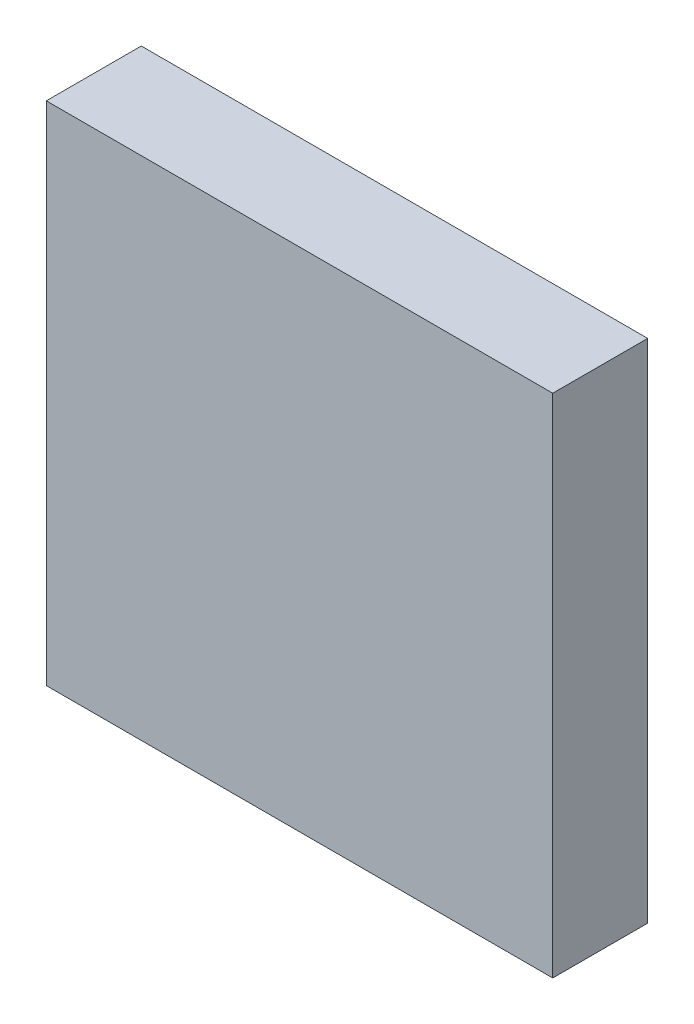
ISO-10303-21;
HEADER;
FILE_DESCRIPTION(('STEP AP214'),'2;1');
FILE_NAME('part.step','',(''),(''),'','','');
FILE_SCHEMA(('AUTOMOTIVE_DESIGN { 1 0 10303 214 1 1 1 1 }'));
ENDSEC;
DATA;
#1=APPLICATION_CONTEXT('core data for automotive mechanical design processes');
#2=APPLICATION_PROTOCOL_DEFINITION('international standard','automotive_design',2000,#1);
#3=PRODUCT_CONTEXT('',#1,'mechanical');
#4=PRODUCT('Part','Part','',(#3));
#5=PRODUCT_RELATED_PRODUCT_CATEGORY('part','',(#4));
#6=PRODUCT_DEFINITION_FORMATION('','',#4);
#7=PRODUCT_DEFINITION_CONTEXT('part definition',#1,'design');
#8=PRODUCT_DEFINITION('design','',#6,#7);
#9=PRODUCT_DEFINITION_SHAPE('','',#8);
#10=(LENGTH_UNIT() NAMED_UNIT(*) SI_UNIT(.MILLI.,.METRE.));
#11=(NAMED_UNIT(*) PLANE_ANGLE_UNIT() SI_UNIT($,.RADIAN.));
#12=(NAMED_UNIT(*) SI_UNIT($,.STERADIAN.) SOLID_ANGLE_UNIT());
#13=UNCERTAINTY_MEASURE_WITH_UNIT(LENGTH_MEASURE(1.E-05),#10,'distance_accuracy_value','');
#14=(GEOMETRIC_REPRESENTATION_CONTEXT(3) GLOBAL_UNCERTAINTY_ASSIGNED_CONTEXT((#13)) GLOBAL_UNIT_ASSIGNED_CONTEXT((#10,
#11,#12)) REPRESENTATION_CONTEXT('',''));
#15=CARTESIAN_POINT('',(0.,0.,0.));
#16=DIRECTION('',(0.,0.,1.));
#17=DIRECTION('',(1.,0.,0.));
#18=AXIS2_PLACEMENT_3D('',#15,#16,#17);
#19=CARTESIAN_POINT('',(0.,-101.6,0.));
#20=DIRECTION('',(-1.,0.,0.));
#21=DIRECTION('',(0.,0.,1.));
#22=AXIS2_PLACEMENT_3D('',#19,#20,#21);
#23=PLANE('',#22);
#24=DIRECTION('',(0.,0.,1.));
#25=VECTOR('',#24,1.);
#26=CARTESIAN_POINT('',(0.,0.,0.));
#27=LINE('',#26,#25);
#28=CARTESIAN_POINT('',(0.,0.,-19.05));
#29=VERTEX_POINT('',#28);
#30=CARTESIAN_POINT('',(0.,0.,0.));
#31=VERTEX_POINT('',#30);
#32=EDGE_CURVE('E96',#29,#31,#27,.T.);
#33=ORIENTED_EDGE('',*,*,#32,.F.);
#34=DIRECTION('',(0.,1.,0.));
#35=VECTOR('',#34,1.);
#36=CARTESIAN_POINT('',(0.,-101.6,-19.05));
#37=LINE('',#36,#35);
#38=CARTESIAN_POINT('',(0.,-101.6,-19.05));
#39=VERTEX_POINT('',#38);
#40=EDGE_CURVE('E11',#39,#29,#37,.T.);
#41=ORIENTED_EDGE('',*,*,#40,.F.);
#42=DIRECTION('',(0.,0.,1.));
#43=VECTOR('',#42,1.);
#44=CARTESIAN_POINT('',(0.,-101.6,0.));
#45=LINE('',#44,#43);
#46=CARTESIAN_POINT('',(0.,-101.6,0.));
#47=VERTEX_POINT('',#46);
#48=EDGE_CURVE('E90',#39,#47,#45,.T.);
#49=ORIENTED_EDGE('',*,*,#48,.T.);
#50=DIRECTION('',(0.,1.,0.));
#51=VECTOR('',#50,1.);
#52=CARTESIAN_POINT('',(0.,-101.6,0.));
#53=LINE('',#52,#51);
#54=EDGE_CURVE('E35',#47,#31,#53,.T.);
#55=ORIENTED_EDGE('',*,*,#54,.T.);
#56=EDGE_LOOP('',(#33,#41,#49,#55));
#57=FACE_BOUND('',#56,.T.);
#58=ADVANCED_FACE('F32',(#57),#23,.T.);
#59=CARTESIAN_POINT('',(0.,-101.6,-19.05));
#60=DIRECTION('',(0.,0.,-1.));
#61=DIRECTION('',(-1.,0.,0.));
#62=AXIS2_PLACEMENT_3D('',#59,#60,#61);
#63=PLANE('',#62);
#64=DIRECTION('',(-1.,0.,0.));
#65=VECTOR('',#64,1.);
#66=CARTESIAN_POINT('',(0.,0.,-19.05));
#67=LINE('',#66,#65);
#68=CARTESIAN_POINT('',(101.6,0.,-19.05));
#69=VERTEX_POINT('',#68);
#70=EDGE_CURVE('E92',#69,#29,#67,.T.);
#71=ORIENTED_EDGE('',*,*,#70,.F.);
#72=DIRECTION('',(0.,1.,0.));
#73=VECTOR('',#72,1.);
#74=CARTESIAN_POINT('',(101.6,-101.6,-19.05));
#75=LINE('',#74,#73);
#76=CARTESIAN_POINT('',(101.6,-101.6,-19.05));
#77=VERTEX_POINT('',#76);
#78=EDGE_CURVE('E41',#77,#69,#75,.T.);
#79=ORIENTED_EDGE('',*,*,#78,.F.);
#80=DIRECTION('',(-1.,0.,0.));
#81=VECTOR('',#80,1.);
#82=CARTESIAN_POINT('',(0.,-101.6,-19.05));
#83=LINE('',#82,#81);
#84=EDGE_CURVE('E87',#77,#39,#83,.T.);
#85=ORIENTED_EDGE('',*,*,#84,.T.);
#86=ORIENTED_EDGE('',*,*,#40,.T.);
#87=EDGE_LOOP('',(#71,#79,#85,#86));
#88=FACE_BOUND('',#87,.T.);
#89=ADVANCED_FACE('F106',(#88),#63,.T.);
#90=CARTESIAN_POINT('',(101.6,-101.6,0.));
#91=DIRECTION('',(1.,0.,0.));
#92=DIRECTION('',(0.,0.,-1.));
#93=AXIS2_PLACEMENT_3D('',#90,#91,#92);
#94=PLANE('',#93);
#95=DIRECTION('',(0.,0.,-1.));
#96=VECTOR('',#95,1.);
#97=CARTESIAN_POINT('',(101.6,0.,0.));
#98=LINE('',#97,#96);
#99=CARTESIAN_POINT('',(101.6,0.,0.));
#100=VERTEX_POINT('',#99);
#101=EDGE_CURVE('E82',#100,#69,#98,.T.);
#102=ORIENTED_EDGE('',*,*,#101,.F.);
#103=DIRECTION('',(0.,1.,0.));
#104=VECTOR('',#103,1.);
#105=CARTESIAN_POINT('',(101.6,-101.6,0.));
#106=LINE('',#105,#104);
#107=CARTESIAN_POINT('',(101.6,-101.6,0.));
#108=VERTEX_POINT('',#107);
#109=EDGE_CURVE('E77',#108,#100,#106,.T.);
#110=ORIENTED_EDGE('',*,*,#109,.F.);
#111=DIRECTION('',(0.,0.,-1.));
#112=VECTOR('',#111,1.);
#113=CARTESIAN_POINT('',(101.6,-101.6,0.));
#114=LINE('',#113,#112);
#115=EDGE_CURVE('E80',#108,#77,#114,.T.);
#116=ORIENTED_EDGE('',*,*,#115,.T.);
#117=ORIENTED_EDGE('',*,*,#78,.T.);
#118=EDGE_LOOP('',(#102,#110,#116,#117));
#119=FACE_BOUND('',#118,.T.);
#120=ADVANCED_FACE('F79',(#119),#94,.T.);
#121=CARTESIAN_POINT('',(0.,-101.6,0.));
#122=DIRECTION('',(0.,0.,1.));
#123=DIRECTION('',(1.,0.,0.));
#124=AXIS2_PLACEMENT_3D('',#121,#122,#123);
#125=PLANE('',#124);
#126=DIRECTION('',(1.,0.,0.));
#127=VECTOR('',#126,1.);
#128=CARTESIAN_POINT('',(0.,0.,0.));
#129=LINE('',#128,#127);
#130=EDGE_CURVE('E99',#31,#100,#129,.T.);
#131=ORIENTED_EDGE('',*,*,#130,.F.);
#132=ORIENTED_EDGE('',*,*,#54,.F.);
#133=DIRECTION('',(1.,0.,0.));
#134=VECTOR('',#133,1.);
#135=CARTESIAN_POINT('',(0.,-101.6,0.));
#136=LINE('',#135,#134);
#137=EDGE_CURVE('E86',#47,#108,#136,.T.);
#138=ORIENTED_EDGE('',*,*,#137,.T.);
#139=ORIENTED_EDGE('',*,*,#109,.T.);
#140=EDGE_LOOP('',(#131,#132,#138,#139));
#141=FACE_BOUND('',#140,.T.);
#142=ADVANCED_FACE('F89',(#141),#125,.T.);
#143=CARTESIAN_POINT('',(0.,-101.6,-19.05));
#144=DIRECTION('',(0.,-1.,0.));
#145=DIRECTION('',(0.,0.,-1.));
#146=AXIS2_PLACEMENT_3D('',#143,#144,#145);
#147=PLANE('',#146);
#148=ORIENTED_EDGE('',*,*,#48,.F.);
#149=ORIENTED_EDGE('',*,*,#84,.F.);
#150=ORIENTED_EDGE('',*,*,#115,.F.);
#151=ORIENTED_EDGE('',*,*,#137,.F.);
#152=EDGE_LOOP('',(#148,#149,#150,#151));
#153=FACE_BOUND('',#152,.T.);
#154=ADVANCED_FACE('F85',(#153),#147,.T.);
#155=CARTESIAN_POINT('',(0.,0.,-19.05));
#156=DIRECTION('',(0.,-1.,0.));
#157=DIRECTION('',(0.,0.,-1.));
#158=AXIS2_PLACEMENT_3D('',#155,#156,#157);
#159=PLANE('',#158);
#160=ORIENTED_EDGE('',*,*,#32,.T.);
#161=ORIENTED_EDGE('',*,*,#130,.T.);
#162=ORIENTED_EDGE('',*,*,#101,.T.);
#163=ORIENTED_EDGE('',*,*,#70,.T.);
#164=EDGE_LOOP('',(#160,#161,#162,#163));
#165=FACE_BOUND('',#164,.T.);
#166=ADVANCED_FACE('F105',(#165),#159,.F.);
#167=CLOSED_SHELL('',(#58,#89,#120,#142,#154,#166));
#168=MANIFOLD_SOLID_BREP('B2',#167);
#169=ADVANCED_BREP_SHAPE_REPRESENTATION('',(#18,#168),#14);
#170=SHAPE_DEFINITION_REPRESENTATION(#9,#169);
ENDSEC;
END-ISO-10303-21;
